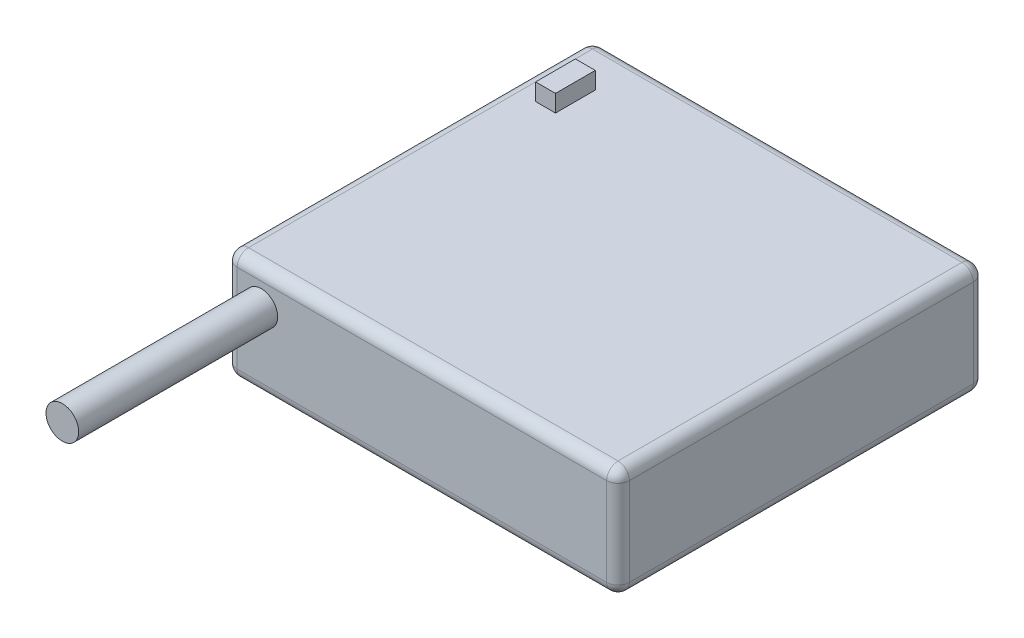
ISO-10303-21;
HEADER;
FILE_DESCRIPTION(('STEP AP214'),'2;1');
FILE_NAME('part.step','',(''),(''),'','','');
FILE_SCHEMA(('AUTOMOTIVE_DESIGN { 1 0 10303 214 1 1 1 1 }'));
ENDSEC;
DATA;
#1=APPLICATION_CONTEXT('core data for automotive mechanical design processes');
#2=APPLICATION_PROTOCOL_DEFINITION('international standard','automotive_design',2000,#1);
#3=PRODUCT_CONTEXT('',#1,'mechanical');
#4=PRODUCT('Part','Part','',(#3));
#5=PRODUCT_RELATED_PRODUCT_CATEGORY('part','',(#4));
#6=PRODUCT_DEFINITION_FORMATION('','',#4);
#7=PRODUCT_DEFINITION_CONTEXT('part definition',#1,'design');
#8=PRODUCT_DEFINITION('design','',#6,#7);
#9=PRODUCT_DEFINITION_SHAPE('','',#8);
#10=(LENGTH_UNIT() NAMED_UNIT(*) SI_UNIT(.MILLI.,.METRE.));
#11=(NAMED_UNIT(*) PLANE_ANGLE_UNIT() SI_UNIT($,.RADIAN.));
#12=(NAMED_UNIT(*) SI_UNIT($,.STERADIAN.) SOLID_ANGLE_UNIT());
#13=UNCERTAINTY_MEASURE_WITH_UNIT(LENGTH_MEASURE(1.E-05),#10,'distance_accuracy_value','');
#14=(GEOMETRIC_REPRESENTATION_CONTEXT(3) GLOBAL_UNCERTAINTY_ASSIGNED_CONTEXT((#13)) GLOBAL_UNIT_ASSIGNED_CONTEXT((#10,
#11,#12)) REPRESENTATION_CONTEXT('',''));
#15=CARTESIAN_POINT('',(0.,0.,0.));
#16=DIRECTION('',(0.,0.,1.));
#17=DIRECTION('',(1.,0.,0.));
#18=AXIS2_PLACEMENT_3D('',#15,#16,#17);
#19=CARTESIAN_POINT('',(69.,19.5,0.));
#20=DIRECTION('',(0.,-1.,0.));
#21=DIRECTION('',(0.,0.,-1.));
#22=AXIS2_PLACEMENT_3D('',#19,#20,#21);
#23=PLANE('',#22);
#24=DIRECTION('',(-1.,0.,0.));
#25=VECTOR('',#24,1.);
#26=CARTESIAN_POINT('',(69.,19.5,-2.));
#27=LINE('',#26,#25);
#28=CARTESIAN_POINT('',(2.,19.5,-2.));
#29=VERTEX_POINT('',#28);
#30=CARTESIAN_POINT('',(67.,19.5,-2.));
#31=VERTEX_POINT('',#30);
#32=EDGE_CURVE('E193',#29,#31,#27,.F.);
#33=ORIENTED_EDGE('',*,*,#32,.T.);
#34=DIRECTION('',(0.,0.,1.));
#35=VECTOR('',#34,1.);
#36=CARTESIAN_POINT('',(67.,19.5,0.));
#37=LINE('',#36,#35);
#38=CARTESIAN_POINT('',(67.,19.5,-62.5));
#39=VERTEX_POINT('',#38);
#40=EDGE_CURVE('E42',#31,#39,#37,.F.);
#41=ORIENTED_EDGE('',*,*,#40,.T.);
#42=DIRECTION('',(-1.,0.,0.));
#43=VECTOR('',#42,1.);
#44=CARTESIAN_POINT('',(69.,19.5,-62.5));
#45=LINE('',#44,#43);
#46=CARTESIAN_POINT('',(2.,19.5,-62.5));
#47=VERTEX_POINT('',#46);
#48=EDGE_CURVE('E190',#39,#47,#45,.T.);
#49=ORIENTED_EDGE('',*,*,#48,.T.);
#50=DIRECTION('',(0.,0.,1.));
#51=VECTOR('',#50,1.);
#52=CARTESIAN_POINT('',(2.,19.5,-2.));
#53=LINE('',#52,#51);
#54=EDGE_CURVE('E250',#47,#29,#53,.T.);
#55=ORIENTED_EDGE('',*,*,#54,.T.);
#56=EDGE_LOOP('',(#33,#41,#49,#55));
#57=FACE_BOUND('',#56,.T.);
#58=DIRECTION('',(0.,0.,1.));
#59=VECTOR('',#58,1.);
#60=CARTESIAN_POINT('',(5.,19.5,-56.5));
#61=LINE('',#60,#59);
#62=CARTESIAN_POINT('',(5.,19.5,-56.5));
#63=VERTEX_POINT('',#62);
#64=CARTESIAN_POINT('',(5.,19.5,-49.5));
#65=VERTEX_POINT('',#64);
#66=EDGE_CURVE('E167',#63,#65,#61,.T.);
#67=ORIENTED_EDGE('',*,*,#66,.F.);
#68=DIRECTION('',(-1.,0.,0.));
#69=VECTOR('',#68,1.);
#70=CARTESIAN_POINT('',(5.,19.5,-56.5));
#71=LINE('',#70,#69);
#72=CARTESIAN_POINT('',(8.5,19.5,-56.5));
#73=VERTEX_POINT('',#72);
#74=EDGE_CURVE('E164',#73,#63,#71,.T.);
#75=ORIENTED_EDGE('',*,*,#74,.F.);
#76=DIRECTION('',(0.,0.,-1.));
#77=VECTOR('',#76,1.);
#78=CARTESIAN_POINT('',(8.5,19.5,-56.5));
#79=LINE('',#78,#77);
#80=CARTESIAN_POINT('',(8.5,19.5,-49.5));
#81=VERTEX_POINT('',#80);
#82=EDGE_CURVE('E54',#81,#73,#79,.T.);
#83=ORIENTED_EDGE('',*,*,#82,.F.);
#84=DIRECTION('',(1.,0.,0.));
#85=VECTOR('',#84,1.);
#86=CARTESIAN_POINT('',(5.,19.5,-49.5));
#87=LINE('',#86,#85);
#88=EDGE_CURVE('E49',#65,#81,#87,.T.);
#89=ORIENTED_EDGE('',*,*,#88,.F.);
#90=EDGE_LOOP('',(#67,#75,#83,#89));
#91=FACE_BOUND('',#90,.T.);
#92=ADVANCED_FACE('F34',(#57,#91),#23,.F.);
#93=CARTESIAN_POINT('',(69.,0.,0.));
#94=DIRECTION('',(0.,0.,-1.));
#95=DIRECTION('',(-1.,0.,0.));
#96=AXIS2_PLACEMENT_3D('',#93,#94,#95);
#97=PLANE('',#96);
#98=DIRECTION('',(-1.,0.,0.));
#99=VECTOR('',#98,1.);
#100=CARTESIAN_POINT('',(69.,2.,0.));
#101=LINE('',#100,#99);
#102=CARTESIAN_POINT('',(2.,2.,0.));
#103=VERTEX_POINT('',#102);
#104=CARTESIAN_POINT('',(67.,2.,0.));
#105=VERTEX_POINT('',#104);
#106=EDGE_CURVE('E187',#103,#105,#101,.F.);
#107=ORIENTED_EDGE('',*,*,#106,.T.);
#108=DIRECTION('',(0.,-1.,0.));
#109=VECTOR('',#108,1.);
#110=CARTESIAN_POINT('',(67.,0.,0.));
#111=LINE('',#110,#109);
#112=CARTESIAN_POINT('',(67.,17.5,0.));
#113=VERTEX_POINT('',#112);
#114=EDGE_CURVE('E235',#105,#113,#111,.F.);
#115=ORIENTED_EDGE('',*,*,#114,.T.);
#116=DIRECTION('',(-1.,0.,0.));
#117=VECTOR('',#116,1.);
#118=CARTESIAN_POINT('',(69.,17.5,0.));
#119=LINE('',#118,#117);
#120=CARTESIAN_POINT('',(2.,17.5,0.));
#121=VERTEX_POINT('',#120);
#122=EDGE_CURVE('E184',#113,#121,#119,.T.);
#123=ORIENTED_EDGE('',*,*,#122,.T.);
#124=DIRECTION('',(0.,-1.,0.));
#125=VECTOR('',#124,1.);
#126=CARTESIAN_POINT('',(2.,2.,0.));
#127=LINE('',#126,#125);
#128=EDGE_CURVE('E233',#121,#103,#127,.T.);
#129=ORIENTED_EDGE('',*,*,#128,.T.);
#130=EDGE_LOOP('',(#107,#115,#123,#129));
#131=FACE_BOUND('',#130,.T.);
#132=CARTESIAN_POINT('',(6.25,13.5,0.));
#133=DIRECTION('',(0.,0.,-1.));
#134=DIRECTION('',(-1.,0.,0.));
#135=AXIS2_PLACEMENT_3D('',#132,#133,#134);
#136=CIRCLE('',#135,2.875);
#137=CARTESIAN_POINT('',(3.375,13.5,0.));
#138=VERTEX_POINT('',#137);
#139=EDGE_CURVE('E11',#138,#138,#136,.F.);
#140=ORIENTED_EDGE('',*,*,#139,.F.);
#141=EDGE_LOOP('',(#140));
#142=FACE_BOUND('',#141,.T.);
#143=ADVANCED_FACE('F338',(#131,#142),#97,.F.);
#144=CARTESIAN_POINT('',(69.,0.,0.));
#145=DIRECTION('',(0.,1.,0.));
#146=DIRECTION('',(0.,0.,1.));
#147=AXIS2_PLACEMENT_3D('',#144,#145,#146);
#148=PLANE('',#147);
#149=DIRECTION('',(-1.,0.,0.));
#150=VECTOR('',#149,1.);
#151=CARTESIAN_POINT('',(69.,0.,-62.5));
#152=LINE('',#151,#150);
#153=CARTESIAN_POINT('',(2.,0.,-62.5));
#154=VERTEX_POINT('',#153);
#155=CARTESIAN_POINT('',(67.,0.,-62.5));
#156=VERTEX_POINT('',#155);
#157=EDGE_CURVE('E177',#154,#156,#152,.F.);
#158=ORIENTED_EDGE('',*,*,#157,.T.);
#159=DIRECTION('',(0.,0.,-1.));
#160=VECTOR('',#159,1.);
#161=CARTESIAN_POINT('',(67.,0.,0.));
#162=LINE('',#161,#160);
#163=CARTESIAN_POINT('',(67.,0.,-2.));
#164=VERTEX_POINT('',#163);
#165=EDGE_CURVE('E227',#156,#164,#162,.F.);
#166=ORIENTED_EDGE('',*,*,#165,.T.);
#167=DIRECTION('',(-1.,0.,0.));
#168=VECTOR('',#167,1.);
#169=CARTESIAN_POINT('',(69.,0.,-2.));
#170=LINE('',#169,#168);
#171=CARTESIAN_POINT('',(2.,0.,-2.));
#172=VERTEX_POINT('',#171);
#173=EDGE_CURVE('E180',#164,#172,#170,.T.);
#174=ORIENTED_EDGE('',*,*,#173,.T.);
#175=DIRECTION('',(0.,0.,-1.));
#176=VECTOR('',#175,1.);
#177=CARTESIAN_POINT('',(2.,0.,-62.5));
#178=LINE('',#177,#176);
#179=EDGE_CURVE('E225',#172,#154,#178,.T.);
#180=ORIENTED_EDGE('',*,*,#179,.T.);
#181=EDGE_LOOP('',(#158,#166,#174,#180));
#182=FACE_BOUND('',#181,.T.);
#183=ADVANCED_FACE('F309',(#182),#148,.F.);
#184=CARTESIAN_POINT('',(69.,0.,-64.5));
#185=DIRECTION('',(0.,0.,1.));
#186=DIRECTION('',(1.,0.,0.));
#187=AXIS2_PLACEMENT_3D('',#184,#185,#186);
#188=PLANE('',#187);
#189=DIRECTION('',(-1.,0.,0.));
#190=VECTOR('',#189,1.);
#191=CARTESIAN_POINT('',(69.,17.5,-64.5));
#192=LINE('',#191,#190);
#193=CARTESIAN_POINT('',(2.,17.5,-64.5));
#194=VERTEX_POINT('',#193);
#195=CARTESIAN_POINT('',(67.,17.5,-64.5));
#196=VERTEX_POINT('',#195);
#197=EDGE_CURVE('E196',#194,#196,#192,.F.);
#198=ORIENTED_EDGE('',*,*,#197,.T.);
#199=DIRECTION('',(0.,1.,0.));
#200=VECTOR('',#199,1.);
#201=CARTESIAN_POINT('',(67.,0.,-64.5));
#202=LINE('',#201,#200);
#203=CARTESIAN_POINT('',(67.,2.,-64.5));
#204=VERTEX_POINT('',#203);
#205=EDGE_CURVE('E219',#196,#204,#202,.F.);
#206=ORIENTED_EDGE('',*,*,#205,.T.);
#207=DIRECTION('',(-1.,0.,0.));
#208=VECTOR('',#207,1.);
#209=CARTESIAN_POINT('',(69.,2.,-64.5));
#210=LINE('',#209,#208);
#211=CARTESIAN_POINT('',(2.,2.,-64.5));
#212=VERTEX_POINT('',#211);
#213=EDGE_CURVE('E199',#204,#212,#210,.T.);
#214=ORIENTED_EDGE('',*,*,#213,.T.);
#215=DIRECTION('',(0.,1.,0.));
#216=VECTOR('',#215,1.);
#217=CARTESIAN_POINT('',(2.,17.5,-64.5));
#218=LINE('',#217,#216);
#219=EDGE_CURVE('E217',#212,#194,#218,.T.);
#220=ORIENTED_EDGE('',*,*,#219,.T.);
#221=EDGE_LOOP('',(#198,#206,#214,#220));
#222=FACE_BOUND('',#221,.T.);
#223=ADVANCED_FACE('F364',(#222),#188,.F.);
#224=CARTESIAN_POINT('',(69.,0.,0.));
#225=DIRECTION('',(-1.,0.,0.));
#226=DIRECTION('',(0.,0.,1.));
#227=AXIS2_PLACEMENT_3D('',#224,#225,#226);
#228=PLANE('',#227);
#229=DIRECTION('',(0.,0.,-1.));
#230=VECTOR('',#229,1.);
#231=CARTESIAN_POINT('',(69.,2.,0.));
#232=LINE('',#231,#230);
#233=CARTESIAN_POINT('',(69.,2.,-2.));
#234=VERTEX_POINT('',#233);
#235=CARTESIAN_POINT('',(69.,2.,-62.5));
#236=VERTEX_POINT('',#235);
#237=EDGE_CURVE('E212',#234,#236,#232,.T.);
#238=ORIENTED_EDGE('',*,*,#237,.T.);
#239=DIRECTION('',(0.,1.,0.));
#240=VECTOR('',#239,1.);
#241=CARTESIAN_POINT('',(69.,0.,-62.5));
#242=LINE('',#241,#240);
#243=CARTESIAN_POINT('',(69.,17.5,-62.5));
#244=VERTEX_POINT('',#243);
#245=EDGE_CURVE('E214',#236,#244,#242,.T.);
#246=ORIENTED_EDGE('',*,*,#245,.T.);
#247=DIRECTION('',(0.,0.,1.));
#248=VECTOR('',#247,1.);
#249=CARTESIAN_POINT('',(69.,17.5,0.));
#250=LINE('',#249,#248);
#251=CARTESIAN_POINT('',(69.,17.5,-2.));
#252=VERTEX_POINT('',#251);
#253=EDGE_CURVE('E208',#244,#252,#250,.T.);
#254=ORIENTED_EDGE('',*,*,#253,.T.);
#255=DIRECTION('',(0.,-1.,0.));
#256=VECTOR('',#255,1.);
#257=CARTESIAN_POINT('',(69.,0.,-2.));
#258=LINE('',#257,#256);
#259=EDGE_CURVE('E210',#252,#234,#258,.T.);
#260=ORIENTED_EDGE('',*,*,#259,.T.);
#261=EDGE_LOOP('',(#238,#246,#254,#260));
#262=FACE_BOUND('',#261,.T.);
#263=ADVANCED_FACE('F328',(#262),#228,.F.);
#264=CARTESIAN_POINT('',(0.,0.,0.));
#265=DIRECTION('',(-1.,0.,0.));
#266=DIRECTION('',(0.,0.,1.));
#267=AXIS2_PLACEMENT_3D('',#264,#265,#266);
#268=PLANE('',#267);
#269=DIRECTION('',(0.,0.,1.));
#270=VECTOR('',#269,1.);
#271=CARTESIAN_POINT('',(0.,17.5,-62.5));
#272=LINE('',#271,#270);
#273=CARTESIAN_POINT('',(0.,17.5,-2.));
#274=VERTEX_POINT('',#273);
#275=CARTESIAN_POINT('',(0.,17.5,-62.5));
#276=VERTEX_POINT('',#275);
#277=EDGE_CURVE('E241',#274,#276,#272,.F.);
#278=ORIENTED_EDGE('',*,*,#277,.T.);
#279=DIRECTION('',(0.,1.,0.));
#280=VECTOR('',#279,1.);
#281=CARTESIAN_POINT('',(0.,2.,-62.5));
#282=LINE('',#281,#280);
#283=CARTESIAN_POINT('',(0.,2.,-62.5));
#284=VERTEX_POINT('',#283);
#285=EDGE_CURVE('E247',#276,#284,#282,.F.);
#286=ORIENTED_EDGE('',*,*,#285,.T.);
#287=DIRECTION('',(0.,0.,-1.));
#288=VECTOR('',#287,1.);
#289=CARTESIAN_POINT('',(0.,2.,-2.));
#290=LINE('',#289,#288);
#291=CARTESIAN_POINT('',(0.,2.,-2.));
#292=VERTEX_POINT('',#291);
#293=EDGE_CURVE('E245',#284,#292,#290,.F.);
#294=ORIENTED_EDGE('',*,*,#293,.T.);
#295=DIRECTION('',(0.,-1.,0.));
#296=VECTOR('',#295,1.);
#297=CARTESIAN_POINT('',(0.,17.5,-2.));
#298=LINE('',#297,#296);
#299=EDGE_CURVE('E243',#292,#274,#298,.F.);
#300=ORIENTED_EDGE('',*,*,#299,.T.);
#301=EDGE_LOOP('',(#278,#286,#294,#300));
#302=FACE_BOUND('',#301,.T.);
#303=ADVANCED_FACE('F389',(#302),#268,.T.);
#304=CARTESIAN_POINT('',(69.,2.,-2.));
#305=DIRECTION('',(-1.,0.,0.));
#306=DIRECTION('',(0.,0.,1.));
#307=AXIS2_PLACEMENT_3D('',#304,#305,#306);
#308=CYLINDRICAL_SURFACE('',#307,2.);
#309=ORIENTED_EDGE('',*,*,#173,.F.);
#310=CARTESIAN_POINT('',(67.,2.,-2.));
#311=DIRECTION('',(-1.,0.,0.));
#312=DIRECTION('',(0.,0.,1.));
#313=AXIS2_PLACEMENT_3D('',#310,#311,#312);
#314=CIRCLE('',#313,2.);
#315=EDGE_CURVE('E231',#164,#105,#314,.T.);
#316=ORIENTED_EDGE('',*,*,#315,.T.);
#317=ORIENTED_EDGE('',*,*,#106,.F.);
#318=CARTESIAN_POINT('',(2.,2.,-2.));
#319=DIRECTION('',(-1.,0.,0.));
#320=DIRECTION('',(0.,0.,1.));
#321=AXIS2_PLACEMENT_3D('',#318,#319,#320);
#322=CIRCLE('',#321,2.);
#323=EDGE_CURVE('E229',#103,#172,#322,.F.);
#324=ORIENTED_EDGE('',*,*,#323,.T.);
#325=EDGE_LOOP('',(#309,#316,#317,#324));
#326=FACE_BOUND('',#325,.T.);
#327=ADVANCED_FACE('F306',(#326),#308,.T.);
#328=CARTESIAN_POINT('',(69.,17.5,-2.));
#329=DIRECTION('',(-1.,0.,0.));
#330=DIRECTION('',(0.,0.,1.));
#331=AXIS2_PLACEMENT_3D('',#328,#329,#330);
#332=CYLINDRICAL_SURFACE('',#331,2.);
#333=ORIENTED_EDGE('',*,*,#122,.F.);
#334=CARTESIAN_POINT('',(67.,17.5,-2.));
#335=DIRECTION('',(-1.,0.,0.));
#336=DIRECTION('',(0.,0.,1.));
#337=AXIS2_PLACEMENT_3D('',#334,#335,#336);
#338=CIRCLE('',#337,2.);
#339=EDGE_CURVE('E239',#113,#31,#338,.T.);
#340=ORIENTED_EDGE('',*,*,#339,.T.);
#341=ORIENTED_EDGE('',*,*,#32,.F.);
#342=CARTESIAN_POINT('',(2.,17.5,-2.));
#343=DIRECTION('',(-1.,0.,0.));
#344=DIRECTION('',(0.,0.,1.));
#345=AXIS2_PLACEMENT_3D('',#342,#343,#344);
#346=CIRCLE('',#345,2.);
#347=EDGE_CURVE('E237',#29,#121,#346,.F.);
#348=ORIENTED_EDGE('',*,*,#347,.T.);
#349=EDGE_LOOP('',(#333,#340,#341,#348));
#350=FACE_BOUND('',#349,.T.);
#351=ADVANCED_FACE('F342',(#350),#332,.T.);
#352=CARTESIAN_POINT('',(69.,2.,-62.5));
#353=DIRECTION('',(-1.,0.,0.));
#354=DIRECTION('',(0.,0.,1.));
#355=AXIS2_PLACEMENT_3D('',#352,#353,#354);
#356=CYLINDRICAL_SURFACE('',#355,2.);
#357=ORIENTED_EDGE('',*,*,#213,.F.);
#358=CARTESIAN_POINT('',(67.,2.,-62.5));
#359=DIRECTION('',(-1.,0.,0.));
#360=DIRECTION('',(0.,0.,1.));
#361=AXIS2_PLACEMENT_3D('',#358,#359,#360);
#362=CIRCLE('',#361,2.);
#363=EDGE_CURVE('E223',#204,#156,#362,.T.);
#364=ORIENTED_EDGE('',*,*,#363,.T.);
#365=ORIENTED_EDGE('',*,*,#157,.F.);
#366=CARTESIAN_POINT('',(2.,2.,-62.5));
#367=DIRECTION('',(-1.,0.,0.));
#368=DIRECTION('',(0.,0.,1.));
#369=AXIS2_PLACEMENT_3D('',#366,#367,#368);
#370=CIRCLE('',#369,2.);
#371=EDGE_CURVE('E221',#154,#212,#370,.F.);
#372=ORIENTED_EDGE('',*,*,#371,.T.);
#373=EDGE_LOOP('',(#357,#364,#365,#372));
#374=FACE_BOUND('',#373,.T.);
#375=ADVANCED_FACE('F367',(#374),#356,.T.);
#376=CARTESIAN_POINT('',(69.,17.5,-62.5));
#377=DIRECTION('',(-1.,0.,0.));
#378=DIRECTION('',(0.,0.,1.));
#379=AXIS2_PLACEMENT_3D('',#376,#377,#378);
#380=CYLINDRICAL_SURFACE('',#379,2.);
#381=ORIENTED_EDGE('',*,*,#48,.F.);
#382=CARTESIAN_POINT('',(67.,17.5,-62.5));
#383=DIRECTION('',(-1.,0.,0.));
#384=DIRECTION('',(0.,0.,1.));
#385=AXIS2_PLACEMENT_3D('',#382,#383,#384);
#386=CIRCLE('',#385,2.);
#387=EDGE_CURVE('E205',#39,#196,#386,.T.);
#388=ORIENTED_EDGE('',*,*,#387,.T.);
#389=ORIENTED_EDGE('',*,*,#197,.F.);
#390=CARTESIAN_POINT('',(2.,17.5,-62.5));
#391=DIRECTION('',(-1.,0.,0.));
#392=DIRECTION('',(0.,0.,1.));
#393=AXIS2_PLACEMENT_3D('',#390,#391,#392);
#394=CIRCLE('',#393,2.);
#395=EDGE_CURVE('E202',#194,#47,#394,.F.);
#396=ORIENTED_EDGE('',*,*,#395,.T.);
#397=EDGE_LOOP('',(#381,#388,#389,#396));
#398=FACE_BOUND('',#397,.T.);
#399=ADVANCED_FACE('F357',(#398),#380,.T.);
#400=CARTESIAN_POINT('',(67.,2.,-2.));
#401=DIRECTION('',(0.,0.,1.));
#402=DIRECTION('',(1.,0.,0.));
#403=AXIS2_PLACEMENT_3D('',#400,#401,#402);
#404=SPHERICAL_SURFACE('',#403,2.);
#405=CARTESIAN_POINT('',(67.,2.,-2.));
#406=DIRECTION('',(0.,1.,0.));
#407=DIRECTION('',(0.,0.,1.));
#408=AXIS2_PLACEMENT_3D('',#405,#406,#407);
#409=CIRCLE('',#408,2.);
#410=EDGE_CURVE('E270',#105,#234,#409,.T.);
#411=ORIENTED_EDGE('',*,*,#410,.F.);
#412=ORIENTED_EDGE('',*,*,#315,.F.);
#413=CARTESIAN_POINT('',(67.,2.,-2.));
#414=DIRECTION('',(0.,0.,-1.));
#415=DIRECTION('',(-1.,0.,0.));
#416=AXIS2_PLACEMENT_3D('',#413,#414,#415);
#417=CIRCLE('',#416,2.);
#418=EDGE_CURVE('E181',#234,#164,#417,.T.);
#419=ORIENTED_EDGE('',*,*,#418,.F.);
#420=EDGE_LOOP('',(#411,#412,#419));
#421=FACE_BOUND('',#420,.T.);
#422=ADVANCED_FACE('F336',(#421),#404,.T.);
#423=CARTESIAN_POINT('',(67.,2.,0.));
#424=DIRECTION('',(0.,0.,-1.));
#425=DIRECTION('',(-1.,0.,0.));
#426=AXIS2_PLACEMENT_3D('',#423,#424,#425);
#427=CYLINDRICAL_SURFACE('',#426,2.);
#428=ORIENTED_EDGE('',*,*,#418,.T.);
#429=ORIENTED_EDGE('',*,*,#165,.F.);
#430=CARTESIAN_POINT('',(67.,2.,-62.5));
#431=DIRECTION('',(0.,0.,-1.));
#432=DIRECTION('',(-1.,0.,0.));
#433=AXIS2_PLACEMENT_3D('',#430,#431,#432);
#434=CIRCLE('',#433,2.);
#435=EDGE_CURVE('E267',#236,#156,#434,.T.);
#436=ORIENTED_EDGE('',*,*,#435,.F.);
#437=ORIENTED_EDGE('',*,*,#237,.F.);
#438=EDGE_LOOP('',(#428,#429,#436,#437));
#439=FACE_BOUND('',#438,.T.);
#440=ADVANCED_FACE('F314',(#439),#427,.T.);
#441=CARTESIAN_POINT('',(67.,0.,-2.));
#442=DIRECTION('',(0.,-1.,0.));
#443=DIRECTION('',(0.,0.,-1.));
#444=AXIS2_PLACEMENT_3D('',#441,#442,#443);
#445=CYLINDRICAL_SURFACE('',#444,2.);
#446=ORIENTED_EDGE('',*,*,#410,.T.);
#447=ORIENTED_EDGE('',*,*,#259,.F.);
#448=CARTESIAN_POINT('',(67.,17.5,-2.));
#449=DIRECTION('',(0.,1.,0.));
#450=DIRECTION('',(0.,0.,1.));
#451=AXIS2_PLACEMENT_3D('',#448,#449,#450);
#452=CIRCLE('',#451,2.);
#453=EDGE_CURVE('E264',#113,#252,#452,.T.);
#454=ORIENTED_EDGE('',*,*,#453,.F.);
#455=ORIENTED_EDGE('',*,*,#114,.F.);
#456=EDGE_LOOP('',(#446,#447,#454,#455));
#457=FACE_BOUND('',#456,.T.);
#458=ADVANCED_FACE('F334',(#457),#445,.T.);
#459=CARTESIAN_POINT('',(67.,2.,-62.5));
#460=DIRECTION('',(0.,0.,1.));
#461=DIRECTION('',(1.,0.,0.));
#462=AXIS2_PLACEMENT_3D('',#459,#460,#461);
#463=SPHERICAL_SURFACE('',#462,2.);
#464=ORIENTED_EDGE('',*,*,#435,.T.);
#465=ORIENTED_EDGE('',*,*,#363,.F.);
#466=CARTESIAN_POINT('',(67.,2.,-62.5));
#467=DIRECTION('',(0.,1.,0.));
#468=DIRECTION('',(0.,0.,1.));
#469=AXIS2_PLACEMENT_3D('',#466,#467,#468);
#470=CIRCLE('',#469,2.);
#471=EDGE_CURVE('E261',#236,#204,#470,.T.);
#472=ORIENTED_EDGE('',*,*,#471,.F.);
#473=EDGE_LOOP('',(#464,#465,#472));
#474=FACE_BOUND('',#473,.T.);
#475=ADVANCED_FACE('F320',(#474),#463,.T.);
#476=CARTESIAN_POINT('',(67.,17.5,-2.));
#477=DIRECTION('',(0.,0.,1.));
#478=DIRECTION('',(1.,0.,0.));
#479=AXIS2_PLACEMENT_3D('',#476,#477,#478);
#480=SPHERICAL_SURFACE('',#479,2.);
#481=ORIENTED_EDGE('',*,*,#339,.F.);
#482=ORIENTED_EDGE('',*,*,#453,.T.);
#483=CARTESIAN_POINT('',(67.,17.5,-2.));
#484=DIRECTION('',(0.,0.,-1.));
#485=DIRECTION('',(-1.,0.,0.));
#486=AXIS2_PLACEMENT_3D('',#483,#484,#485);
#487=CIRCLE('',#486,2.);
#488=EDGE_CURVE('E258',#31,#252,#487,.T.);
#489=ORIENTED_EDGE('',*,*,#488,.F.);
#490=EDGE_LOOP('',(#481,#482,#489));
#491=FACE_BOUND('',#490,.T.);
#492=ADVANCED_FACE('F348',(#491),#480,.T.);
#493=CARTESIAN_POINT('',(67.,0.,-62.5));
#494=DIRECTION('',(0.,1.,0.));
#495=DIRECTION('',(0.,0.,1.));
#496=AXIS2_PLACEMENT_3D('',#493,#494,#495);
#497=CYLINDRICAL_SURFACE('',#496,2.);
#498=ORIENTED_EDGE('',*,*,#471,.T.);
#499=ORIENTED_EDGE('',*,*,#205,.F.);
#500=CARTESIAN_POINT('',(67.,17.5,-62.5));
#501=DIRECTION('',(0.,1.,0.));
#502=DIRECTION('',(0.,0.,1.));
#503=AXIS2_PLACEMENT_3D('',#500,#501,#502);
#504=CIRCLE('',#503,2.);
#505=EDGE_CURVE('E255',#244,#196,#504,.T.);
#506=ORIENTED_EDGE('',*,*,#505,.F.);
#507=ORIENTED_EDGE('',*,*,#245,.F.);
#508=EDGE_LOOP('',(#498,#499,#506,#507));
#509=FACE_BOUND('',#508,.T.);
#510=ADVANCED_FACE('F325',(#509),#497,.T.);
#511=CARTESIAN_POINT('',(67.,17.5,0.));
#512=DIRECTION('',(0.,0.,1.));
#513=DIRECTION('',(1.,0.,0.));
#514=AXIS2_PLACEMENT_3D('',#511,#512,#513);
#515=CYLINDRICAL_SURFACE('',#514,2.);
#516=ORIENTED_EDGE('',*,*,#488,.T.);
#517=ORIENTED_EDGE('',*,*,#253,.F.);
#518=CARTESIAN_POINT('',(67.,17.5,-62.5));
#519=DIRECTION('',(0.,0.,-1.));
#520=DIRECTION('',(-1.,0.,0.));
#521=AXIS2_PLACEMENT_3D('',#518,#519,#520);
#522=CIRCLE('',#521,2.);
#523=EDGE_CURVE('E253',#39,#244,#522,.T.);
#524=ORIENTED_EDGE('',*,*,#523,.F.);
#525=ORIENTED_EDGE('',*,*,#40,.F.);
#526=EDGE_LOOP('',(#516,#517,#524,#525));
#527=FACE_BOUND('',#526,.T.);
#528=ADVANCED_FACE('F352',(#527),#515,.T.);
#529=CARTESIAN_POINT('',(67.,17.5,-62.5));
#530=DIRECTION('',(0.,0.,1.));
#531=DIRECTION('',(1.,0.,0.));
#532=AXIS2_PLACEMENT_3D('',#529,#530,#531);
#533=SPHERICAL_SURFACE('',#532,2.);
#534=ORIENTED_EDGE('',*,*,#505,.T.);
#535=ORIENTED_EDGE('',*,*,#387,.F.);
#536=ORIENTED_EDGE('',*,*,#523,.T.);
#537=EDGE_LOOP('',(#534,#535,#536));
#538=FACE_BOUND('',#537,.T.);
#539=ADVANCED_FACE('F361',(#538),#533,.T.);
#540=CARTESIAN_POINT('',(2.,2.,-2.));
#541=DIRECTION('',(0.,0.,1.));
#542=DIRECTION('',(1.,0.,0.));
#543=AXIS2_PLACEMENT_3D('',#540,#541,#542);
#544=SPHERICAL_SURFACE('',#543,2.);
#545=CARTESIAN_POINT('',(2.,2.,-2.));
#546=DIRECTION('',(0.,0.,-1.));
#547=DIRECTION('',(-1.,0.,0.));
#548=AXIS2_PLACEMENT_3D('',#545,#546,#547);
#549=CIRCLE('',#548,2.);
#550=EDGE_CURVE('E290',#172,#292,#549,.T.);
#551=ORIENTED_EDGE('',*,*,#550,.F.);
#552=ORIENTED_EDGE('',*,*,#323,.F.);
#553=CARTESIAN_POINT('',(2.,2.,-2.));
#554=DIRECTION('',(0.,1.,0.));
#555=DIRECTION('',(0.,0.,1.));
#556=AXIS2_PLACEMENT_3D('',#553,#554,#555);
#557=CIRCLE('',#556,2.);
#558=EDGE_CURVE('E256',#292,#103,#557,.T.);
#559=ORIENTED_EDGE('',*,*,#558,.F.);
#560=EDGE_LOOP('',(#551,#552,#559));
#561=FACE_BOUND('',#560,.T.);
#562=ADVANCED_FACE('F36',(#561),#544,.T.);
#563=CARTESIAN_POINT('',(2.,0.,-2.));
#564=DIRECTION('',(0.,1.,0.));
#565=DIRECTION('',(0.,0.,1.));
#566=AXIS2_PLACEMENT_3D('',#563,#564,#565);
#567=CYLINDRICAL_SURFACE('',#566,2.);
#568=ORIENTED_EDGE('',*,*,#558,.T.);
#569=ORIENTED_EDGE('',*,*,#128,.F.);
#570=CARTESIAN_POINT('',(2.,17.5,-2.));
#571=DIRECTION('',(0.,1.,0.));
#572=DIRECTION('',(0.,0.,1.));
#573=AXIS2_PLACEMENT_3D('',#570,#571,#572);
#574=CIRCLE('',#573,2.);
#575=EDGE_CURVE('E287',#274,#121,#574,.T.);
#576=ORIENTED_EDGE('',*,*,#575,.F.);
#577=ORIENTED_EDGE('',*,*,#299,.F.);
#578=EDGE_LOOP('',(#568,#569,#576,#577));
#579=FACE_BOUND('',#578,.T.);
#580=ADVANCED_FACE('F297',(#579),#567,.T.);
#581=CARTESIAN_POINT('',(2.,2.,0.));
#582=DIRECTION('',(0.,0.,1.));
#583=DIRECTION('',(1.,0.,0.));
#584=AXIS2_PLACEMENT_3D('',#581,#582,#583);
#585=CYLINDRICAL_SURFACE('',#584,2.);
#586=ORIENTED_EDGE('',*,*,#550,.T.);
#587=ORIENTED_EDGE('',*,*,#293,.F.);
#588=CARTESIAN_POINT('',(2.,2.,-62.5));
#589=DIRECTION('',(0.,0.,-1.));
#590=DIRECTION('',(-1.,0.,0.));
#591=AXIS2_PLACEMENT_3D('',#588,#589,#590);
#592=CIRCLE('',#591,2.);
#593=EDGE_CURVE('E284',#154,#284,#592,.T.);
#594=ORIENTED_EDGE('',*,*,#593,.F.);
#595=ORIENTED_EDGE('',*,*,#179,.F.);
#596=EDGE_LOOP('',(#586,#587,#594,#595));
#597=FACE_BOUND('',#596,.T.);
#598=ADVANCED_FACE('F391',(#597),#585,.T.);
#599=CARTESIAN_POINT('',(2.,17.5,-2.));
#600=DIRECTION('',(0.,0.,1.));
#601=DIRECTION('',(1.,0.,0.));
#602=AXIS2_PLACEMENT_3D('',#599,#600,#601);
#603=SPHERICAL_SURFACE('',#602,2.);
#604=ORIENTED_EDGE('',*,*,#575,.T.);
#605=ORIENTED_EDGE('',*,*,#347,.F.);
#606=CARTESIAN_POINT('',(2.,17.5,-2.));
#607=DIRECTION('',(0.,0.,-1.));
#608=DIRECTION('',(-1.,0.,0.));
#609=AXIS2_PLACEMENT_3D('',#606,#607,#608);
#610=CIRCLE('',#609,2.);
#611=EDGE_CURVE('E281',#274,#29,#610,.T.);
#612=ORIENTED_EDGE('',*,*,#611,.F.);
#613=EDGE_LOOP('',(#604,#605,#612));
#614=FACE_BOUND('',#613,.T.);
#615=ADVANCED_FACE('F387',(#614),#603,.T.);
#616=CARTESIAN_POINT('',(2.,2.,-62.5));
#617=DIRECTION('',(0.,0.,1.));
#618=DIRECTION('',(1.,0.,0.));
#619=AXIS2_PLACEMENT_3D('',#616,#617,#618);
#620=SPHERICAL_SURFACE('',#619,2.);
#621=ORIENTED_EDGE('',*,*,#371,.F.);
#622=ORIENTED_EDGE('',*,*,#593,.T.);
#623=CARTESIAN_POINT('',(2.,2.,-62.5));
#624=DIRECTION('',(0.,1.,0.));
#625=DIRECTION('',(0.,0.,1.));
#626=AXIS2_PLACEMENT_3D('',#623,#624,#625);
#627=CIRCLE('',#626,2.);
#628=EDGE_CURVE('E279',#212,#284,#627,.T.);
#629=ORIENTED_EDGE('',*,*,#628,.F.);
#630=EDGE_LOOP('',(#621,#622,#629));
#631=FACE_BOUND('',#630,.T.);
#632=ADVANCED_FACE('F371',(#631),#620,.T.);
#633=CARTESIAN_POINT('',(2.,17.5,0.));
#634=DIRECTION('',(0.,0.,-1.));
#635=DIRECTION('',(-1.,0.,0.));
#636=AXIS2_PLACEMENT_3D('',#633,#634,#635);
#637=CYLINDRICAL_SURFACE('',#636,2.);
#638=ORIENTED_EDGE('',*,*,#611,.T.);
#639=ORIENTED_EDGE('',*,*,#54,.F.);
#640=CARTESIAN_POINT('',(2.,17.5,-62.5));
#641=DIRECTION('',(0.,0.,-1.));
#642=DIRECTION('',(-1.,0.,0.));
#643=AXIS2_PLACEMENT_3D('',#640,#641,#642);
#644=CIRCLE('',#643,2.);
#645=EDGE_CURVE('E277',#276,#47,#644,.T.);
#646=ORIENTED_EDGE('',*,*,#645,.F.);
#647=ORIENTED_EDGE('',*,*,#277,.F.);
#648=EDGE_LOOP('',(#638,#639,#646,#647));
#649=FACE_BOUND('',#648,.T.);
#650=ADVANCED_FACE('F384',(#649),#637,.T.);
#651=CARTESIAN_POINT('',(2.,0.,-62.5));
#652=DIRECTION('',(0.,-1.,0.));
#653=DIRECTION('',(0.,0.,-1.));
#654=AXIS2_PLACEMENT_3D('',#651,#652,#653);
#655=CYLINDRICAL_SURFACE('',#654,2.);
#656=ORIENTED_EDGE('',*,*,#628,.T.);
#657=ORIENTED_EDGE('',*,*,#285,.F.);
#658=CARTESIAN_POINT('',(2.,17.5,-62.5));
#659=DIRECTION('',(0.,1.,0.));
#660=DIRECTION('',(0.,0.,1.));
#661=AXIS2_PLACEMENT_3D('',#658,#659,#660);
#662=CIRCLE('',#661,2.);
#663=EDGE_CURVE('E171',#194,#276,#662,.T.);
#664=ORIENTED_EDGE('',*,*,#663,.F.);
#665=ORIENTED_EDGE('',*,*,#219,.F.);
#666=EDGE_LOOP('',(#656,#657,#664,#665));
#667=FACE_BOUND('',#666,.T.);
#668=ADVANCED_FACE('F377',(#667),#655,.T.);
#669=CARTESIAN_POINT('',(2.,17.5,-62.5));
#670=DIRECTION('',(0.,0.,1.));
#671=DIRECTION('',(1.,0.,0.));
#672=AXIS2_PLACEMENT_3D('',#669,#670,#671);
#673=SPHERICAL_SURFACE('',#672,2.);
#674=ORIENTED_EDGE('',*,*,#645,.T.);
#675=ORIENTED_EDGE('',*,*,#395,.F.);
#676=ORIENTED_EDGE('',*,*,#663,.T.);
#677=EDGE_LOOP('',(#674,#675,#676));
#678=FACE_BOUND('',#677,.T.);
#679=ADVANCED_FACE('F379',(#678),#673,.T.);
#680=CARTESIAN_POINT('',(6.25,13.5,35.));
#681=DIRECTION('',(0.,0.,-1.));
#682=DIRECTION('',(-1.,0.,0.));
#683=AXIS2_PLACEMENT_3D('',#680,#681,#682);
#684=CYLINDRICAL_SURFACE('',#683,2.875);
#685=CARTESIAN_POINT('',(6.25,13.5,35.));
#686=DIRECTION('',(0.,0.,1.));
#687=DIRECTION('',(1.,0.,0.));
#688=AXIS2_PLACEMENT_3D('',#685,#686,#687);
#689=CIRCLE('',#688,2.875);
#690=CARTESIAN_POINT('',(9.125,13.5,35.));
#691=VERTEX_POINT('',#690);
#692=EDGE_CURVE('E168',#691,#691,#689,.T.);
#693=ORIENTED_EDGE('',*,*,#692,.F.);
#694=EDGE_LOOP('',(#693));
#695=FACE_BOUND('',#694,.T.);
#696=ORIENTED_EDGE('',*,*,#139,.T.);
#697=EDGE_LOOP('',(#696));
#698=FACE_BOUND('',#697,.T.);
#699=ADVANCED_FACE('F438',(#695,#698),#684,.T.);
#700=CARTESIAN_POINT('',(6.25,13.5,35.));
#701=DIRECTION('',(0.,0.,1.));
#702=DIRECTION('',(1.,0.,0.));
#703=AXIS2_PLACEMENT_3D('',#700,#701,#702);
#704=PLANE('',#703);
#705=ORIENTED_EDGE('',*,*,#692,.T.);
#706=EDGE_LOOP('',(#705));
#707=FACE_BOUND('',#706,.T.);
#708=ADVANCED_FACE('F467',(#707),#704,.T.);
#709=CARTESIAN_POINT('',(5.,22.5,-56.5));
#710=DIRECTION('',(1.,0.,0.));
#711=DIRECTION('',(0.,0.,-1.));
#712=AXIS2_PLACEMENT_3D('',#709,#710,#711);
#713=PLANE('',#712);
#714=ORIENTED_EDGE('',*,*,#66,.T.);
#715=DIRECTION('',(0.,-1.,0.));
#716=VECTOR('',#715,1.);
#717=CARTESIAN_POINT('',(5.,22.5,-49.5));
#718=LINE('',#717,#716);
#719=CARTESIAN_POINT('',(5.,22.5,-49.5));
#720=VERTEX_POINT('',#719);
#721=EDGE_CURVE('E148',#720,#65,#718,.T.);
#722=ORIENTED_EDGE('',*,*,#721,.F.);
#723=DIRECTION('',(0.,0.,1.));
#724=VECTOR('',#723,1.);
#725=CARTESIAN_POINT('',(5.,22.5,-56.5));
#726=LINE('',#725,#724);
#727=CARTESIAN_POINT('',(5.,22.5,-56.5));
#728=VERTEX_POINT('',#727);
#729=EDGE_CURVE('E155',#728,#720,#726,.T.);
#730=ORIENTED_EDGE('',*,*,#729,.F.);
#731=DIRECTION('',(0.,-1.,0.));
#732=VECTOR('',#731,1.);
#733=CARTESIAN_POINT('',(5.,22.5,-56.5));
#734=LINE('',#733,#732);
#735=EDGE_CURVE('E680',#728,#63,#734,.T.);
#736=ORIENTED_EDGE('',*,*,#735,.T.);
#737=EDGE_LOOP('',(#714,#722,#730,#736));
#738=FACE_BOUND('',#737,.T.);
#739=ADVANCED_FACE('F166',(#738),#713,.F.);
#740=CARTESIAN_POINT('',(5.,22.5,-49.5));
#741=DIRECTION('',(0.,0.,-1.));
#742=DIRECTION('',(-1.,0.,0.));
#743=AXIS2_PLACEMENT_3D('',#740,#741,#742);
#744=PLANE('',#743);
#745=ORIENTED_EDGE('',*,*,#88,.T.);
#746=DIRECTION('',(0.,-1.,0.));
#747=VECTOR('',#746,1.);
#748=CARTESIAN_POINT('',(8.5,22.5,-49.5));
#749=LINE('',#748,#747);
#750=CARTESIAN_POINT('',(8.5,22.5,-49.5));
#751=VERTEX_POINT('',#750);
#752=EDGE_CURVE('E151',#751,#81,#749,.T.);
#753=ORIENTED_EDGE('',*,*,#752,.F.);
#754=DIRECTION('',(1.,0.,0.));
#755=VECTOR('',#754,1.);
#756=CARTESIAN_POINT('',(5.,22.5,-49.5));
#757=LINE('',#756,#755);
#758=EDGE_CURVE('E144',#720,#751,#757,.T.);
#759=ORIENTED_EDGE('',*,*,#758,.F.);
#760=ORIENTED_EDGE('',*,*,#721,.T.);
#761=EDGE_LOOP('',(#745,#753,#759,#760));
#762=FACE_BOUND('',#761,.T.);
#763=ADVANCED_FACE('F146',(#762),#744,.F.);
#764=CARTESIAN_POINT('',(8.5,22.5,-56.5));
#765=DIRECTION('',(-1.,0.,0.));
#766=DIRECTION('',(0.,0.,1.));
#767=AXIS2_PLACEMENT_3D('',#764,#765,#766);
#768=PLANE('',#767);
#769=ORIENTED_EDGE('',*,*,#82,.T.);
#770=DIRECTION('',(0.,-1.,0.));
#771=VECTOR('',#770,1.);
#772=CARTESIAN_POINT('',(8.5,22.5,-56.5));
#773=LINE('',#772,#771);
#774=CARTESIAN_POINT('',(8.5,22.5,-56.5));
#775=VERTEX_POINT('',#774);
#776=EDGE_CURVE('E173',#775,#73,#773,.T.);
#777=ORIENTED_EDGE('',*,*,#776,.F.);
#778=DIRECTION('',(0.,0.,-1.));
#779=VECTOR('',#778,1.);
#780=CARTESIAN_POINT('',(8.5,22.5,-56.5));
#781=LINE('',#780,#779);
#782=EDGE_CURVE('E154',#751,#775,#781,.T.);
#783=ORIENTED_EDGE('',*,*,#782,.F.);
#784=ORIENTED_EDGE('',*,*,#752,.T.);
#785=EDGE_LOOP('',(#769,#777,#783,#784));
#786=FACE_BOUND('',#785,.T.);
#787=ADVANCED_FACE('F488',(#786),#768,.F.);
#788=CARTESIAN_POINT('',(5.,22.5,-56.5));
#789=DIRECTION('',(0.,0.,1.));
#790=DIRECTION('',(1.,0.,0.));
#791=AXIS2_PLACEMENT_3D('',#788,#789,#790);
#792=PLANE('',#791);
#793=ORIENTED_EDGE('',*,*,#74,.T.);
#794=ORIENTED_EDGE('',*,*,#735,.F.);
#795=DIRECTION('',(-1.,0.,0.));
#796=VECTOR('',#795,1.);
#797=CARTESIAN_POINT('',(5.,22.5,-56.5));
#798=LINE('',#797,#796);
#799=EDGE_CURVE('E160',#775,#728,#798,.T.);
#800=ORIENTED_EDGE('',*,*,#799,.F.);
#801=ORIENTED_EDGE('',*,*,#776,.T.);
#802=EDGE_LOOP('',(#793,#794,#800,#801));
#803=FACE_BOUND('',#802,.T.);
#804=ADVANCED_FACE('F495',(#803),#792,.F.);
#805=CARTESIAN_POINT('',(0.,22.5,0.));
#806=DIRECTION('',(0.,1.,0.));
#807=DIRECTION('',(0.,0.,1.));
#808=AXIS2_PLACEMENT_3D('',#805,#806,#807);
#809=PLANE('',#808);
#810=ORIENTED_EDGE('',*,*,#729,.T.);
#811=ORIENTED_EDGE('',*,*,#758,.T.);
#812=ORIENTED_EDGE('',*,*,#782,.T.);
#813=ORIENTED_EDGE('',*,*,#799,.T.);
#814=EDGE_LOOP('',(#810,#811,#812,#813));
#815=FACE_BOUND('',#814,.T.);
#816=ADVANCED_FACE('F158',(#815),#809,.T.);
#817=CLOSED_SHELL('',(#92,#143,#183,#223,#263,#303,#327,#351,#375,#399,#422,#440,#458,#475,#492,
#510,#528,#539,#562,#580,#598,#615,#632,#650,#668,#679,#699,#708,#739,#763,#787,#804,#816));
#818=MANIFOLD_SOLID_BREP('B2',#817);
#819=ADVANCED_BREP_SHAPE_REPRESENTATION('',(#18,#818),#14);
#820=SHAPE_DEFINITION_REPRESENTATION(#9,#819);
ENDSEC;
END-ISO-10303-21;
